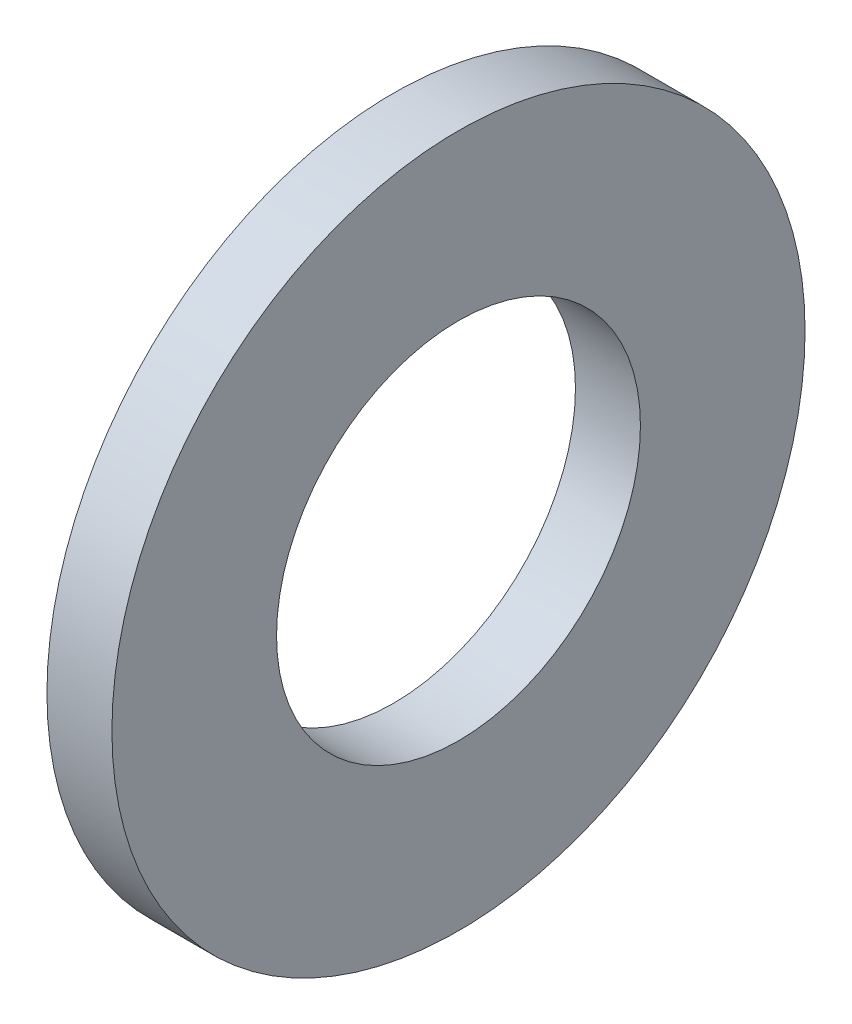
ISO-10303-21;
HEADER;
FILE_DESCRIPTION(('STEP AP214'),'2;1');
FILE_NAME('part.step','',(''),(''),'','','');
FILE_SCHEMA(('AUTOMOTIVE_DESIGN { 1 0 10303 214 1 1 1 1 }'));
ENDSEC;
DATA;
#1=APPLICATION_CONTEXT('core data for automotive mechanical design processes');
#2=APPLICATION_PROTOCOL_DEFINITION('international standard','automotive_design',2000,#1);
#3=PRODUCT_CONTEXT('',#1,'mechanical');
#4=PRODUCT('Part','Part','',(#3));
#5=PRODUCT_RELATED_PRODUCT_CATEGORY('part','',(#4));
#6=PRODUCT_DEFINITION_FORMATION('','',#4);
#7=PRODUCT_DEFINITION_CONTEXT('part definition',#1,'design');
#8=PRODUCT_DEFINITION('design','',#6,#7);
#9=PRODUCT_DEFINITION_SHAPE('','',#8);
#10=(LENGTH_UNIT() NAMED_UNIT(*) SI_UNIT(.MILLI.,.METRE.));
#11=(NAMED_UNIT(*) PLANE_ANGLE_UNIT() SI_UNIT($,.RADIAN.));
#12=(NAMED_UNIT(*) SI_UNIT($,.STERADIAN.) SOLID_ANGLE_UNIT());
#13=UNCERTAINTY_MEASURE_WITH_UNIT(LENGTH_MEASURE(1.E-05),#10,'distance_accuracy_value','');
#14=(GEOMETRIC_REPRESENTATION_CONTEXT(3) GLOBAL_UNCERTAINTY_ASSIGNED_CONTEXT((#13)) GLOBAL_UNIT_ASSIGNED_CONTEXT((#10,
#11,#12)) REPRESENTATION_CONTEXT('',''));
#15=CARTESIAN_POINT('',(0.,0.,0.));
#16=DIRECTION('',(0.,0.,1.));
#17=DIRECTION('',(1.,0.,0.));
#18=AXIS2_PLACEMENT_3D('',#15,#16,#17);
#19=CARTESIAN_POINT('',(0.,0.,-8.));
#20=DIRECTION('',(1.,0.,0.));
#21=DIRECTION('',(0.,0.,-1.));
#22=AXIS2_PLACEMENT_3D('',#19,#20,#21);
#23=PLANE('',#22);
#24=CARTESIAN_POINT('',(0.,0.,0.));
#25=DIRECTION('',(-1.,0.,0.));
#26=DIRECTION('',(0.,0.,1.));
#27=AXIS2_PLACEMENT_3D('',#24,#25,#26);
#28=CIRCLE('',#27,4.2);
#29=CARTESIAN_POINT('',(0.,0.,4.2));
#30=VERTEX_POINT('',#29);
#31=EDGE_CURVE('E10',#30,#30,#28,.T.);
#32=ORIENTED_EDGE('',*,*,#31,.F.);
#33=EDGE_LOOP('',(#32));
#34=FACE_BOUND('',#33,.T.);
#35=CARTESIAN_POINT('',(0.,0.,0.));
#36=DIRECTION('',(-1.,0.,0.));
#37=DIRECTION('',(0.,0.,1.));
#38=AXIS2_PLACEMENT_3D('',#35,#36,#37);
#39=CIRCLE('',#38,8.);
#40=CARTESIAN_POINT('',(0.,0.,8.));
#41=VERTEX_POINT('',#40);
#42=EDGE_CURVE('E42',#41,#41,#39,.T.);
#43=ORIENTED_EDGE('',*,*,#42,.T.);
#44=EDGE_LOOP('',(#43));
#45=FACE_BOUND('',#44,.T.);
#46=ADVANCED_FACE('F28',(#34,#45),#23,.F.);
#47=CARTESIAN_POINT('',(0.,0.,0.));
#48=DIRECTION('',(-1.,0.,0.));
#49=DIRECTION('',(0.,0.,1.));
#50=AXIS2_PLACEMENT_3D('',#47,#48,#49);
#51=CYLINDRICAL_SURFACE('',#50,4.2);
#52=CARTESIAN_POINT('',(1.5,0.,0.));
#53=DIRECTION('',(-1.,0.,0.));
#54=DIRECTION('',(0.,0.,1.));
#55=AXIS2_PLACEMENT_3D('',#52,#53,#54);
#56=CIRCLE('',#55,4.2);
#57=CARTESIAN_POINT('',(1.5,0.,4.2));
#58=VERTEX_POINT('',#57);
#59=EDGE_CURVE('E34',#58,#58,#56,.T.);
#60=ORIENTED_EDGE('',*,*,#59,.F.);
#61=EDGE_LOOP('',(#60));
#62=FACE_BOUND('',#61,.T.);
#63=ORIENTED_EDGE('',*,*,#31,.T.);
#64=EDGE_LOOP('',(#63));
#65=FACE_BOUND('',#64,.T.);
#66=ADVANCED_FACE('F57',(#62,#65),#51,.F.);
#67=CARTESIAN_POINT('',(1.5,0.,-8.));
#68=DIRECTION('',(-1.,0.,0.));
#69=DIRECTION('',(0.,0.,1.));
#70=AXIS2_PLACEMENT_3D('',#67,#68,#69);
#71=PLANE('',#70);
#72=CARTESIAN_POINT('',(1.5,0.,0.));
#73=DIRECTION('',(-1.,0.,0.));
#74=DIRECTION('',(0.,0.,1.));
#75=AXIS2_PLACEMENT_3D('',#72,#73,#74);
#76=CIRCLE('',#75,8.);
#77=CARTESIAN_POINT('',(1.5,0.,8.));
#78=VERTEX_POINT('',#77);
#79=EDGE_CURVE('E38',#78,#78,#76,.T.);
#80=ORIENTED_EDGE('',*,*,#79,.F.);
#81=EDGE_LOOP('',(#80));
#82=FACE_BOUND('',#81,.T.);
#83=ORIENTED_EDGE('',*,*,#59,.T.);
#84=EDGE_LOOP('',(#83));
#85=FACE_BOUND('',#84,.T.);
#86=ADVANCED_FACE('F52',(#82,#85),#71,.F.);
#87=CARTESIAN_POINT('',(0.,0.,0.));
#88=DIRECTION('',(-1.,0.,0.));
#89=DIRECTION('',(0.,0.,1.));
#90=AXIS2_PLACEMENT_3D('',#87,#88,#89);
#91=CYLINDRICAL_SURFACE('',#90,8.);
#92=ORIENTED_EDGE('',*,*,#42,.F.);
#93=EDGE_LOOP('',(#92));
#94=FACE_BOUND('',#93,.T.);
#95=ORIENTED_EDGE('',*,*,#79,.T.);
#96=EDGE_LOOP('',(#95));
#97=FACE_BOUND('',#96,.T.);
#98=ADVANCED_FACE('F49',(#94,#97),#91,.T.);
#99=CLOSED_SHELL('',(#46,#66,#86,#98));
#100=MANIFOLD_SOLID_BREP('B2',#99);
#101=ADVANCED_BREP_SHAPE_REPRESENTATION('',(#18,#100),#14);
#102=SHAPE_DEFINITION_REPRESENTATION(#9,#101);
ENDSEC;
END-ISO-10303-21;
